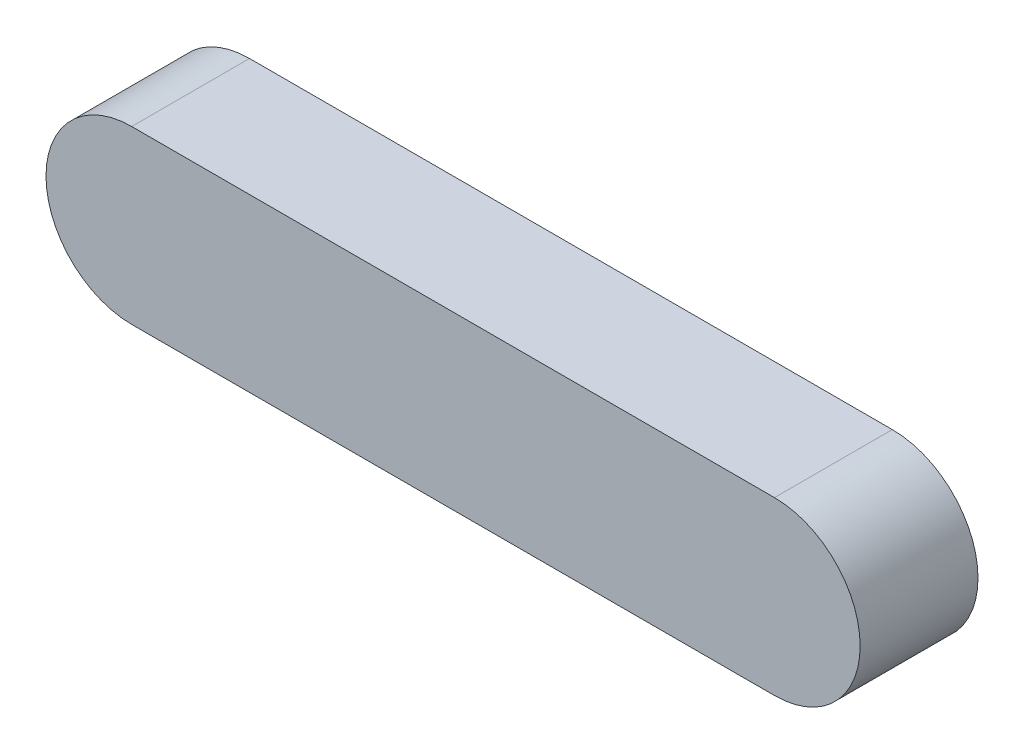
from build123d import *

# Parameters (mm, degrees)
BASE_EXTRUSION_DEPTH = 5.5


with BuildPart() as part:
    # Esquisse1 → Base-Extrusion (new body)
    with BuildSketch(Plane.XY):
        with BuildLine():
            Line((-60, 58), (-30, 58))
            ThreePointArc((-30, 58), (-26, 54), (-30, 50))
            Line((-30, 50), (-60, 50))
            ThreePointArc((-60, 50), (-64, 54), (-60, 58))
        make_face()
    extrude(amount=BASE_EXTRUSION_DEPTH)


solid = part.part
